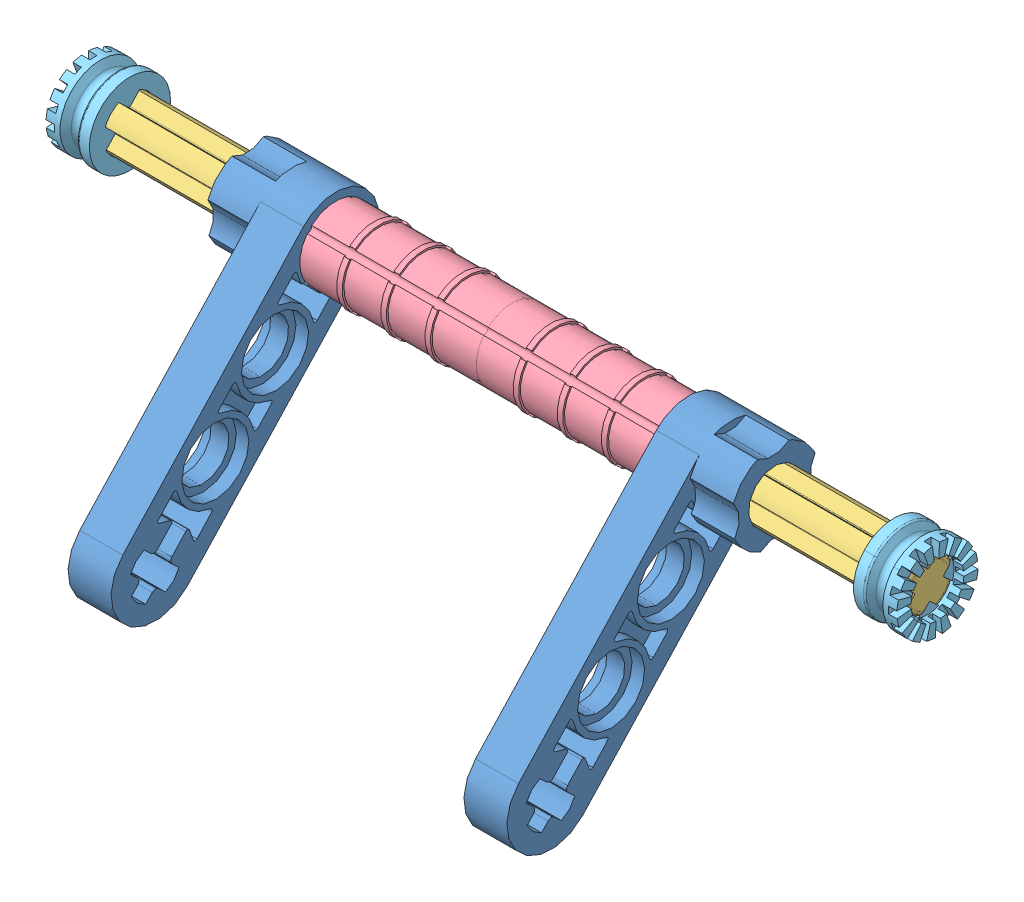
SolidWorks assembly Assem109.SLDASM, configuration Default (file format 4400). Lengths in mm.
Overall size (77.17 28.83 27.62).
9 component instances, 5 part files, 24 mates.
Components (placement in the parent):
- 4 rollbar Grijs-1: 4 rollbar Grijs.sldprt [Default] at (-30.0935 -56.5835 -0.9953) x (0 0.731744 -0.681579) z (0 -0.681579 -0.731744) size (32 7.84 7.94)
- 4 rollbar Grijs-2: 4 rollbar Grijs.sldprt [Default] at (5.8065 -56.5835 -0.9953) x (0 0.731744 -0.681579) z (0 0.681579 0.731744) size (32 7.84 7.94)
- Axle-16--1: Axle-16-.SLDPRT [Predeterminado] at (-12.1435 -47.7797 -9.1956) x (1 0 0) z (0 0.681579 0.731744) size (15.73 4.7 4.7)
- Axle-30--1: Axle-30-.SLDPRT [Predeterminado] at (10.6815 -47.7797 -9.1956) x (1 0 0) z (0 0.681579 0.731744) size (30.08 4.7 4.7)
- Axle-30--2: Axle-30-.SLDPRT [Predeterminado] at (-34.9685 -47.7797 -9.1956) x (1 0 0) z (0 0.681579 0.731744) size (30.08 4.7 4.7)
- Voetsteun Grijs-1: Voetsteun Grijs.SLDPRT [기본 설정] at (3.8565 -47.7797 -9.1956) x (0 0.999371 0.035472) z (1 0 0) size (6.81 6.81 16)
- Voetsteun Grijs-2: Voetsteun Grijs.SLDPRT [기본 설정] at (-12.1435 -47.7797 -9.1956) x (0 0.999371 0.035472) z (1 0 0) size (6.81 6.81 16)
- small collar-1: small collar.sldprt [Default] at (26.4435 -47.7797 -9.1956) x (0 -0.681579 -0.731744) z (0 0.731744 -0.681579) size (7.37 3.94 7.37)
- small collar-2: small collar.sldprt [Default] at (-50.7305 -47.7797 -9.1956) x (0 0.731744 -0.681579) z (0 -0.681579 -0.731744) size (7.37 3.94 7.37)
Mates (geometry in assembly coordinates):
- Coincident1: coincident aligned: plane of 4 rollbar Grijs-1 through (-28.1435 -50.4847 -12.0997) normal (0 -0.681579 -0.731744); plane of 4 rollbar Grijs-2 through (3.8565 -68.0923 4.3008) normal (0 -0.681579 -0.731744)
- Concentric1: concentric anti-aligned: cylinder of 4 rollbar Grijs-1 through (-28.1435 -47.7797 -9.1956) axis (-1 0 0) radius 3.9688; cylinder of 4 rollbar Grijs-2 through (3.8565 -47.7797 -9.1956) axis (1 0 0) radius 3.9688
- Coincident2: coincident anti-aligned: plane of Axle-16--1 through (-19.9685 -47.7797 -9.1956) normal (-1 0 0); plane of Axle-30--2 through (-19.9685 -47.7797 -9.1956) normal (1 0 0)
- Concentric2: concentric aligned: cylinder of Axle-16--1 through (-4.3185 -47.7797 -9.1956) axis (-1 0 0) radius 2.35; cylinder of Axle-30--2 through (-19.9685 -47.7797 -9.1956) axis (-1 0 0) radius 2.35
- Coincident3: coincident aligned: plane of Axle-16--1 through (-4.3185 -45.5778 -10.0166) normal (0 0.681579 0.731744); plane of Axle-30--2 through (-19.9685 -45.5778 -10.0166) normal (0 0.681579 0.731744)
- Coincident4: coincident anti-aligned: plane of Axle-16--1 through (-4.3185 -47.7797 -9.1956) normal (1 0 0); plane of Axle-30--1 through (-4.3185 -47.7797 -9.1956) normal (-1 0 0)
- Concentric3: concentric aligned: cylinder of Axle-16--1 through (-4.3185 -47.7797 -9.1956) axis (-1 0 0) radius 2.35; cylinder of Axle-30--1 through (25.6815 -47.7797 -9.1956) axis (-1 0 0) radius 2.35
- Coincident5: coincident aligned: plane of Axle-16--1 through (-4.3185 -45.5778 -10.0166) normal (0 0.681579 0.731744); plane of Axle-30--1 through (25.6815 -45.5778 -10.0166) normal (0 0.681579 0.731744)
- Concentric4: concentric anti-aligned: cylinder of Axle-30--2 through (-19.9685 -47.7797 -9.1956) axis (-1 0 0) radius 2.35; cylinder of Voetsteun Grijs-2 through (-28.1435 -47.7797 -9.1956) axis (1 0 0) radius 2.35
- Coincident6: coincident anti-aligned: plane of Axle-30--2 through (-19.9685 -45.5778 -10.0166) normal (0 0.681579 0.731744); plane of Voetsteun Grijs-2 through (-28.1435 -45.4835 -10.1044) normal (0 -0.681579 -0.731744)
- Concentric5: concentric anti-aligned: cylinder of Axle-30--1 through (25.6815 -47.7797 -9.1956) axis (-1 0 0) radius 2.35; cylinder of Voetsteun Grijs-1 through (-12.1435 -47.7797 -9.1956) axis (1 0 0) radius 2.35
- Coincident7: coincident anti-aligned: plane of Axle-30--1 through (25.6815 -45.5778 -10.0166) normal (0 0.681579 0.731744); plane of Voetsteun Grijs-1 through (-12.1435 -45.4835 -10.1044) normal (0 -0.681579 -0.731744)
- Coincident8: coincident anti-aligned: plane of Voetsteun Grijs-1 through (-12.1435 -47.7797 -9.1956) normal (-1 0 0); plane of Voetsteun Grijs-2 through (-12.1435 -47.7797 -9.1956) normal (1 0 0)
- Width1: width: plane of Axle-30--2 through (-49.9685 -47.7797 -9.1956) normal (-1 0 0); plane of Axle-30--1 through (25.6815 -47.7797 -9.1956) normal (1 0 0); plane of Voetsteun Grijs-1 through (3.8565 -47.7797 -9.1956) normal (1 0 0); plane of Voetsteun Grijs-2 through (-28.1435 -47.7797 -9.1956) normal (-1 0 0)
- Concentric6: concentric anti-aligned: cylinder of 4 rollbar Grijs-1 through (-32.0435 -47.7797 -9.1956) axis (1 0 0) radius 2.35; cylinder of Axle-30--2 through (-19.9685 -47.7797 -9.1956) axis (-1 0 0) radius 2.35
- Coincident9: coincident anti-aligned: plane of 4 rollbar Grijs-2 through (7.7565 -46.9586 -6.9937) normal (0 0.731744 -0.681579); plane of Axle-30--1 through (25.6815 -46.9586 -6.9937) normal (0 -0.731744 0.681579)
- Coincident10: coincident anti-aligned: plane of 4 rollbar Grijs-1 through (-28.1435 -47.7797 -9.1956) normal (1 0 0); plane of Voetsteun Grijs-2 through (-28.1435 -47.7797 -9.1956) normal (-1 0 0)
- Coincident11: coincident anti-aligned: plane of 4 rollbar Grijs-2 through (3.8565 -47.7797 -9.1956) normal (-1 0 0); plane of Voetsteun Grijs-1 through (3.8565 -47.7797 -9.1956) normal (1 0 0)
- Concentric7: concentric anti-aligned: cylinder of Axle-30--2 through (-19.9685 -47.7797 -9.1956) axis (-1 0 0) radius 2.35; cylinder of small collar-2 through (-50.7315 -47.7797 -9.1956) axis (1 0 0) radius 2.4
- Coincident12: coincident anti-aligned: plane of Axle-30--2 through (-19.9685 -46.9586 -6.9937) normal (0 -0.731744 0.681579); plane of small collar-2 through (-49.8415 -46.9218 -6.9541) normal (0 0.731744 -0.681579)
- Concentric8: concentric aligned: cylinder of Axle-30--1 through (25.6815 -47.7797 -9.1956) axis (-1 0 0) radius 2.35; cylinder of small collar-1 through (26.4445 -47.7797 -9.1956) axis (-1 0 0) radius 2.4
- Coincident14: coincident anti-aligned: plane of Axle-30--1 through (25.6815 -46.9586 -6.9937) normal (0 -0.731744 0.681579); plane of small collar-1 through (25.5545 -46.9218 -6.9541) normal (0 0.731744 -0.681579)
- Coincident17: coincident aligned: plane of Axle-30--1 through (25.6815 -47.7797 -9.1956) normal (1 0 0); plane of small collar-1 through (25.6815 -47.7797 -9.1956) normal (1 0 0)
- Coincident18: coincident aligned: plane of Axle-30--2 through (-49.9685 -47.7797 -9.1956) normal (-1 0 0); plane of small collar-2 through (-49.9685 -47.7797 -9.1956) normal (-1 0 0)
